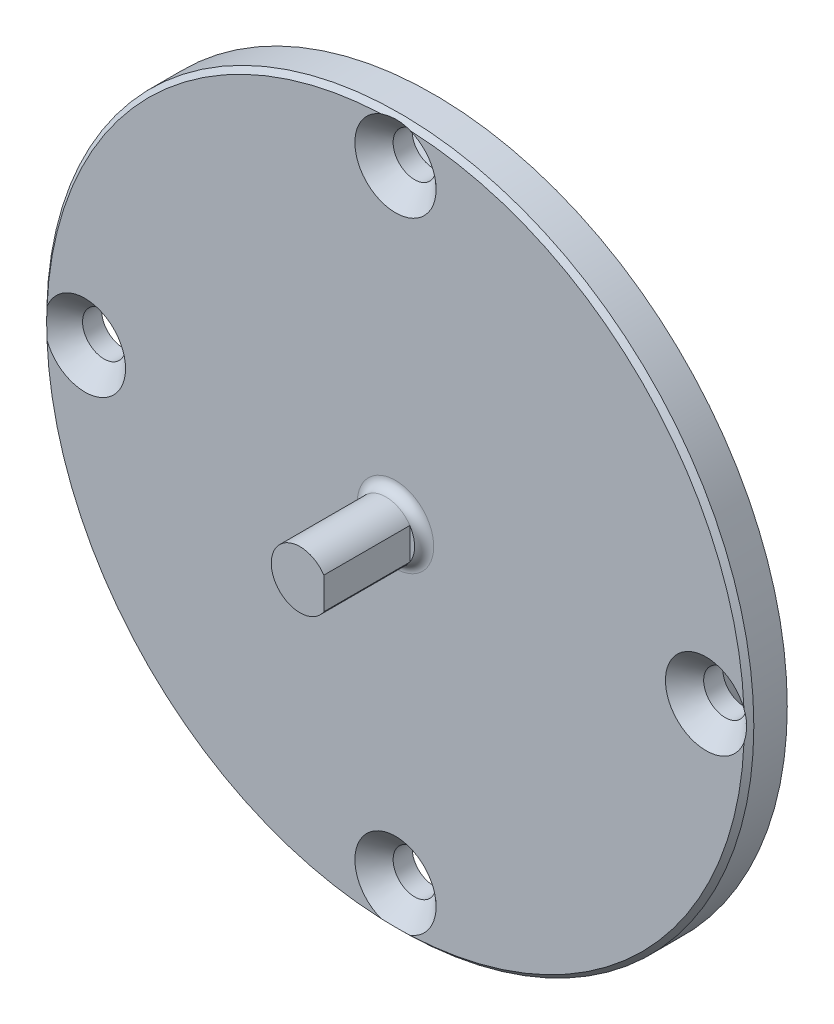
ISO-10303-21;
HEADER;
FILE_DESCRIPTION(('STEP AP214'),'2;1');
FILE_NAME('part.step','',(''),(''),'','','');
FILE_SCHEMA(('AUTOMOTIVE_DESIGN { 1 0 10303 214 1 1 1 1 }'));
ENDSEC;
DATA;
#1=APPLICATION_CONTEXT('core data for automotive mechanical design processes');
#2=APPLICATION_PROTOCOL_DEFINITION('international standard','automotive_design',2000,#1);
#3=PRODUCT_CONTEXT('',#1,'mechanical');
#4=PRODUCT('Part','Part','',(#3));
#5=PRODUCT_RELATED_PRODUCT_CATEGORY('part','',(#4));
#6=PRODUCT_DEFINITION_FORMATION('','',#4);
#7=PRODUCT_DEFINITION_CONTEXT('part definition',#1,'design');
#8=PRODUCT_DEFINITION('design','',#6,#7);
#9=PRODUCT_DEFINITION_SHAPE('','',#8);
#10=(LENGTH_UNIT() NAMED_UNIT(*) SI_UNIT(.MILLI.,.METRE.));
#11=(NAMED_UNIT(*) PLANE_ANGLE_UNIT() SI_UNIT($,.RADIAN.));
#12=(NAMED_UNIT(*) SI_UNIT($,.STERADIAN.) SOLID_ANGLE_UNIT());
#13=UNCERTAINTY_MEASURE_WITH_UNIT(LENGTH_MEASURE(1.E-05),#10,'distance_accuracy_value','');
#14=(GEOMETRIC_REPRESENTATION_CONTEXT(3) GLOBAL_UNCERTAINTY_ASSIGNED_CONTEXT((#13)) GLOBAL_UNIT_ASSIGNED_CONTEXT((#10,
#11,#12)) REPRESENTATION_CONTEXT('',''));
#15=CARTESIAN_POINT('',(0.,0.,0.));
#16=DIRECTION('',(0.,0.,1.));
#17=DIRECTION('',(1.,0.,0.));
#18=AXIS2_PLACEMENT_3D('',#15,#16,#17);
#19=CARTESIAN_POINT('',(0.,0.,0.));
#20=DIRECTION('',(0.,0.,1.));
#21=DIRECTION('',(1.,0.,0.));
#22=AXIS2_PLACEMENT_3D('',#19,#20,#21);
#23=PLANE('',#22);
#24=CARTESIAN_POINT('',(0.,0.,0.));
#25=DIRECTION('',(0.,0.,1.));
#26=DIRECTION('',(1.,0.,0.));
#27=AXIS2_PLACEMENT_3D('',#24,#25,#26);
#28=CIRCLE('',#27,28.8);
#29=CARTESIAN_POINT('',(28.8,0.,0.));
#30=VERTEX_POINT('',#29);
#31=EDGE_CURVE('E11',#30,#30,#28,.T.);
#32=ORIENTED_EDGE('',*,*,#31,.T.);
#33=EDGE_LOOP('',(#32));
#34=FACE_BOUND('',#33,.T.);
#35=CARTESIAN_POINT('',(1.13473209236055E-13,-32.5,0.));
#36=DIRECTION('',(0.,0.,1.));
#37=DIRECTION('',(1.,0.,0.));
#38=AXIS2_PLACEMENT_3D('',#35,#36,#37);
#39=CIRCLE('',#38,2.25);
#40=CARTESIAN_POINT('',(2.25000000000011,-32.5,0.));
#41=VERTEX_POINT('',#40);
#42=EDGE_CURVE('E234',#41,#41,#39,.F.);
#43=ORIENTED_EDGE('',*,*,#42,.F.);
#44=EDGE_LOOP('',(#43));
#45=FACE_BOUND('',#44,.T.);
#46=CARTESIAN_POINT('',(1.13473209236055E-13,32.5,0.));
#47=DIRECTION('',(0.,0.,1.));
#48=DIRECTION('',(1.,0.,0.));
#49=AXIS2_PLACEMENT_3D('',#46,#47,#48);
#50=CIRCLE('',#49,2.25);
#51=CARTESIAN_POINT('',(2.25000000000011,32.5,0.));
#52=VERTEX_POINT('',#51);
#53=EDGE_CURVE('E124',#52,#52,#50,.F.);
#54=ORIENTED_EDGE('',*,*,#53,.F.);
#55=EDGE_LOOP('',(#54));
#56=FACE_BOUND('',#55,.T.);
#57=CARTESIAN_POINT('',(0.,0.,0.));
#58=DIRECTION('',(0.,0.,1.));
#59=DIRECTION('',(1.,0.,0.));
#60=AXIS2_PLACEMENT_3D('',#57,#58,#59);
#61=CIRCLE('',#60,37.);
#62=CARTESIAN_POINT('',(37.,0.,0.));
#63=VERTEX_POINT('',#62);
#64=EDGE_CURVE('E102',#63,#63,#61,.T.);
#65=ORIENTED_EDGE('',*,*,#64,.F.);
#66=EDGE_LOOP('',(#65));
#67=FACE_BOUND('',#66,.T.);
#68=CARTESIAN_POINT('',(-32.5,0.,0.));
#69=DIRECTION('',(0.,0.,1.));
#70=DIRECTION('',(1.,0.,0.));
#71=AXIS2_PLACEMENT_3D('',#68,#69,#70);
#72=CIRCLE('',#71,2.25);
#73=CARTESIAN_POINT('',(-30.25,0.,0.));
#74=VERTEX_POINT('',#73);
#75=EDGE_CURVE('E226',#74,#74,#72,.F.);
#76=ORIENTED_EDGE('',*,*,#75,.F.);
#77=EDGE_LOOP('',(#76));
#78=FACE_BOUND('',#77,.T.);
#79=CARTESIAN_POINT('',(32.5,2.2694641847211E-13,0.));
#80=DIRECTION('',(0.,0.,1.));
#81=DIRECTION('',(1.,0.,0.));
#82=AXIS2_PLACEMENT_3D('',#79,#80,#81);
#83=CIRCLE('',#82,2.25);
#84=CARTESIAN_POINT('',(34.75,2.2694641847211E-13,0.));
#85=VERTEX_POINT('',#84);
#86=EDGE_CURVE('E95',#85,#85,#83,.F.);
#87=ORIENTED_EDGE('',*,*,#86,.F.);
#88=EDGE_LOOP('',(#87));
#89=FACE_BOUND('',#88,.T.);
#90=ADVANCED_FACE('F31',(#34,#45,#56,#67,#78,#89),#23,.F.);
#91=CARTESIAN_POINT('',(0.,0.,4.));
#92=DIRECTION('',(0.,0.,-1.));
#93=DIRECTION('',(-1.,0.,0.));
#94=AXIS2_PLACEMENT_3D('',#91,#92,#93);
#95=CONICAL_SURFACE('',#94,36.5,0.785398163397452);
#96=CARTESIAN_POINT('',(0.,0.,3.5));
#97=DIRECTION('',(0.,0.,1.));
#98=DIRECTION('',(1.,0.,0.));
#99=AXIS2_PLACEMENT_3D('',#96,#97,#98);
#100=CIRCLE('',#99,37.);
#101=CARTESIAN_POINT('',(37.,0.,3.5));
#102=VERTEX_POINT('',#101);
#103=EDGE_CURVE('E106',#102,#102,#100,.F.);
#104=ORIENTED_EDGE('',*,*,#103,.F.);
#105=EDGE_LOOP('',(#104));
#106=FACE_BOUND('',#105,.T.);
#107=CARTESIAN_POINT('',(0.,0.,4.));
#108=DIRECTION('',(0.,0.,1.));
#109=DIRECTION('',(1.,0.,0.));
#110=AXIS2_PLACEMENT_3D('',#107,#108,#109);
#111=CIRCLE('',#110,36.5);
#112=CARTESIAN_POINT('',(36.4682692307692,1.52162390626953,4.));
#113=VERTEX_POINT('',#112);
#114=CARTESIAN_POINT('',(1.52162390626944,36.4682692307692,4.));
#115=VERTEX_POINT('',#114);
#116=EDGE_CURVE('E94',#113,#115,#111,.T.);
#117=ORIENTED_EDGE('',*,*,#116,.F.);
#118=CARTESIAN_POINT('',(36.4680184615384,1.52283601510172,4.0002));
#119=CARTESIAN_POINT('',(36.4850451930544,1.44057411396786,3.98662039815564));
#120=CARTESIAN_POINT('',(36.5007588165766,1.35787566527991,3.97408806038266));
#121=CARTESIAN_POINT('',(36.5294820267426,1.19170734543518,3.9511799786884));
#122=CARTESIAN_POINT('',(36.542491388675,1.108237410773,3.94080441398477));
#123=CARTESIAN_POINT('',(36.5773484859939,0.85679967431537,3.91300427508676));
#124=CARTESIAN_POINT('',(36.595016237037,0.687847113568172,3.89891343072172));
#125=CARTESIAN_POINT('',(36.6184873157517,0.352342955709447,3.8801941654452));
#126=CARTESIAN_POINT('',(36.6245419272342,0.185819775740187,3.87536533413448));
#127=CARTESIAN_POINT('',(36.6254077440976,-0.147183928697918,3.87467480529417));
#128=CARTESIAN_POINT('',(36.6202249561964,-0.313664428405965,3.87880831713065));
#129=CARTESIAN_POINT('',(36.5981529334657,-0.654640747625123,3.89641177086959));
#130=CARTESIAN_POINT('',(36.5806325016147,-0.829071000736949,3.9103851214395));
#131=CARTESIAN_POINT('',(36.5452935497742,-1.08970294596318,3.93856956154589));
#132=CARTESIAN_POINT('',(36.5318970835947,-1.1769261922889,3.94925385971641));
#133=CARTESIAN_POINT('',(36.5021505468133,-1.3505369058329,3.97297809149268));
#134=CARTESIAN_POINT('',(36.4858007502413,-1.43692444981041,3.98601780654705));
#135=CARTESIAN_POINT('',(36.4680184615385,-1.52283601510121,4.0002));
#136=B_SPLINE_CURVE_WITH_KNOTS('',3,(#118,#119,#120,#121,#122,#123,#124,#125,#126,#127,#128,
#129,#130,#131,#132,#133,#134,#135),.UNSPECIFIED.,.F.,.F.,(4,2,2,2,2,2,2,2,4),(0.,
0.255252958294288,0.510527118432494,1.02120905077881,1.52071043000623,2.01994487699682,
2.5467726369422,2.81337195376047,3.07994654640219),.UNSPECIFIED.);
#137=CARTESIAN_POINT('',(36.4682692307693,-1.52162390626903,4.));
#138=VERTEX_POINT('',#137);
#139=EDGE_CURVE('E45',#113,#138,#136,.T.);
#140=ORIENTED_EDGE('',*,*,#139,.T.);
#141=CARTESIAN_POINT('',(1.52162390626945,-36.4682692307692,4.));
#142=VERTEX_POINT('',#141);
#143=EDGE_CURVE('E92',#142,#138,#111,.T.);
#144=ORIENTED_EDGE('',*,*,#143,.F.);
#145=CARTESIAN_POINT('',(1.52283601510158,-36.4680184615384,4.0002));
#146=CARTESIAN_POINT('',(1.44057411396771,-36.4850451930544,3.98662039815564));
#147=CARTESIAN_POINT('',(1.35787566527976,-36.5007588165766,3.97408806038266));
#148=CARTESIAN_POINT('',(1.19170734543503,-36.5294820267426,3.9511799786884));
#149=CARTESIAN_POINT('',(1.10823741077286,-36.542491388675,3.94080441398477));
#150=CARTESIAN_POINT('',(0.856799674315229,-36.5773484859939,3.91300427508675));
#151=CARTESIAN_POINT('',(0.687847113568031,-36.595016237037,3.89891343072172));
#152=CARTESIAN_POINT('',(0.352342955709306,-36.6184873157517,3.8801941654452));
#153=CARTESIAN_POINT('',(0.185819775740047,-36.6245419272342,3.87536533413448));
#154=CARTESIAN_POINT('',(-0.147183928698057,-36.6254077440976,3.87467480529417));
#155=CARTESIAN_POINT('',(-0.313664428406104,-36.6202249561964,3.87880831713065));
#156=CARTESIAN_POINT('',(-0.654640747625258,-36.5981529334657,3.89641177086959));
#157=CARTESIAN_POINT('',(-0.829071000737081,-36.5806325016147,3.9103851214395));
#158=CARTESIAN_POINT('',(-1.08970294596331,-36.5452935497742,3.9385695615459));
#159=CARTESIAN_POINT('',(-1.17692619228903,-36.5318970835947,3.94925385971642));
#160=CARTESIAN_POINT('',(-1.35053690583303,-36.5021505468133,3.97297809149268));
#161=CARTESIAN_POINT('',(-1.43692444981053,-36.4858007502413,3.98601780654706));
#162=CARTESIAN_POINT('',(-1.52283601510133,-36.4680184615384,4.0002));
#163=B_SPLINE_CURVE_WITH_KNOTS('',3,(#145,#146,#147,#148,#149,#150,#151,#152,#153,#154,#155,
#156,#157,#158,#159,#160,#161,#162),.UNSPECIFIED.,.F.,.F.,(4,2,2,2,2,2,2,2,4),(0.,
0.255252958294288,0.510527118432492,1.02120905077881,1.52071043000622,2.01994487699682,
2.54677263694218,2.81337195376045,3.07994654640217),.UNSPECIFIED.);
#164=CARTESIAN_POINT('',(-1.52162390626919,-36.4682692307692,4.));
#165=VERTEX_POINT('',#164);
#166=EDGE_CURVE('E237',#142,#165,#163,.T.);
#167=ORIENTED_EDGE('',*,*,#166,.T.);
#168=CARTESIAN_POINT('',(-36.4682692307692,-1.52162390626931,4.));
#169=VERTEX_POINT('',#168);
#170=EDGE_CURVE('E99',#169,#165,#111,.T.);
#171=ORIENTED_EDGE('',*,*,#170,.F.);
#172=CARTESIAN_POINT('',(-36.4680184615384,-1.52283601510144,4.0002));
#173=CARTESIAN_POINT('',(-36.4850451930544,-1.44057411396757,3.98662039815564));
#174=CARTESIAN_POINT('',(-36.5007588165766,-1.35787566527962,3.97408806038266));
#175=CARTESIAN_POINT('',(-36.5294820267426,-1.19170734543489,3.9511799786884));
#176=CARTESIAN_POINT('',(-36.542491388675,-1.10823741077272,3.94080441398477));
#177=CARTESIAN_POINT('',(-36.5773484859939,-0.856799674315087,3.91300427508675));
#178=CARTESIAN_POINT('',(-36.595016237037,-0.687847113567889,3.89891343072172));
#179=CARTESIAN_POINT('',(-36.6184873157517,-0.352342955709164,3.8801941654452));
#180=CARTESIAN_POINT('',(-36.6245419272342,-0.185819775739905,3.87536533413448));
#181=CARTESIAN_POINT('',(-36.6254077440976,0.1471839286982,3.87467480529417));
#182=CARTESIAN_POINT('',(-36.6202249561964,0.313664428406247,3.87880831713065));
#183=CARTESIAN_POINT('',(-36.5981529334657,0.654640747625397,3.89641177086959));
#184=CARTESIAN_POINT('',(-36.5806325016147,0.829071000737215,3.9103851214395));
#185=CARTESIAN_POINT('',(-36.5452935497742,1.08970294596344,3.9385695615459));
#186=CARTESIAN_POINT('',(-36.5318970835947,1.17692619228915,3.94925385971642));
#187=CARTESIAN_POINT('',(-36.5021505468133,1.35053690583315,3.97297809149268));
#188=CARTESIAN_POINT('',(-36.4858007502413,1.43692444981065,3.98601780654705));
#189=CARTESIAN_POINT('',(-36.4680184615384,1.52283601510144,4.0002));
#190=B_SPLINE_CURVE_WITH_KNOTS('',3,(#172,#173,#174,#175,#176,#177,#178,#179,#180,#181,#182,
#183,#184,#185,#186,#187,#188,#189),.UNSPECIFIED.,.F.,.F.,(4,2,2,2,2,2,2,2,4),(0.,
0.255252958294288,0.510527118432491,1.02120905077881,1.52071043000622,2.01994487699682,
2.54677263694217,2.81337195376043,3.07994654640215),.UNSPECIFIED.);
#191=CARTESIAN_POINT('',(-36.4682692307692,1.52162390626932,4.));
#192=VERTEX_POINT('',#191);
#193=EDGE_CURVE('E123',#169,#192,#190,.T.);
#194=ORIENTED_EDGE('',*,*,#193,.T.);
#195=CARTESIAN_POINT('',(-1.52162390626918,36.4682692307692,4.));
#196=VERTEX_POINT('',#195);
#197=EDGE_CURVE('E101',#196,#192,#111,.T.);
#198=ORIENTED_EDGE('',*,*,#197,.F.);
#199=CARTESIAN_POINT('',(-1.52283601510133,36.4680184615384,4.0002));
#200=CARTESIAN_POINT('',(-1.44057411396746,36.4850451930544,3.98662039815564));
#201=CARTESIAN_POINT('',(-1.35787566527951,36.5007588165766,3.97408806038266));
#202=CARTESIAN_POINT('',(-1.19170734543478,36.5294820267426,3.9511799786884));
#203=CARTESIAN_POINT('',(-1.10823741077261,36.542491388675,3.94080441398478));
#204=CARTESIAN_POINT('',(-0.856799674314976,36.5773484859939,3.91300427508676));
#205=CARTESIAN_POINT('',(-0.687847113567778,36.595016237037,3.89891343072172));
#206=CARTESIAN_POINT('',(-0.352342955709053,36.6184873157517,3.8801941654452));
#207=CARTESIAN_POINT('',(-0.185819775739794,36.6245419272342,3.87536533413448));
#208=CARTESIAN_POINT('',(0.147183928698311,36.6254077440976,3.87467480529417));
#209=CARTESIAN_POINT('',(0.313664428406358,36.6202249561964,3.87880831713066));
#210=CARTESIAN_POINT('',(0.654640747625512,36.5981529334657,3.89641177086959));
#211=CARTESIAN_POINT('',(0.829071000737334,36.5806325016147,3.9103851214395));
#212=CARTESIAN_POINT('',(1.08970294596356,36.5452935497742,3.9385695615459));
#213=CARTESIAN_POINT('',(1.17692619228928,36.5318970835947,3.94925385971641));
#214=CARTESIAN_POINT('',(1.35053690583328,36.5021505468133,3.97297809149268));
#215=CARTESIAN_POINT('',(1.43692444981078,36.4858007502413,3.98601780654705));
#216=CARTESIAN_POINT('',(1.52283601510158,36.4680184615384,4.0002));
#217=B_SPLINE_CURVE_WITH_KNOTS('',3,(#199,#200,#201,#202,#203,#204,#205,#206,#207,#208,#209,
#210,#211,#212,#213,#214,#215,#216),.UNSPECIFIED.,.F.,.F.,(4,2,2,2,2,2,2,2,4),(0.,
0.255252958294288,0.510527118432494,1.02120905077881,1.52071043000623,2.01994487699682,
2.54677263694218,2.81337195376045,3.07994654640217),.UNSPECIFIED.);
#218=EDGE_CURVE('E116',#196,#115,#217,.T.);
#219=ORIENTED_EDGE('',*,*,#218,.T.);
#220=EDGE_LOOP('',(#117,#140,#144,#167,#171,#194,#198,#219));
#221=FACE_BOUND('',#220,.T.);
#222=ADVANCED_FACE('F91',(#106,#221),#95,.T.);
#223=CARTESIAN_POINT('',(0.,0.,4.));
#224=DIRECTION('',(0.,0.,1.));
#225=DIRECTION('',(1.,0.,0.));
#226=AXIS2_PLACEMENT_3D('',#223,#224,#225);
#227=PLANE('',#226);
#228=CARTESIAN_POINT('',(0.,0.,4.));
#229=DIRECTION('',(0.,0.,1.));
#230=DIRECTION('',(1.,0.,0.));
#231=AXIS2_PLACEMENT_3D('',#228,#229,#230);
#232=CIRCLE('',#231,4.);
#233=CARTESIAN_POINT('',(4.,0.,4.));
#234=VERTEX_POINT('',#233);
#235=EDGE_CURVE('E113',#234,#234,#232,.F.);
#236=ORIENTED_EDGE('',*,*,#235,.T.);
#237=EDGE_LOOP('',(#236));
#238=FACE_BOUND('',#237,.T.);
#239=ORIENTED_EDGE('',*,*,#143,.T.);
#240=CARTESIAN_POINT('',(32.5,2.2694641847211E-13,4.));
#241=DIRECTION('',(0.,0.,1.));
#242=DIRECTION('',(1.,0.,0.));
#243=AXIS2_PLACEMENT_3D('',#240,#241,#242);
#244=CIRCLE('',#243,4.25);
#245=EDGE_CURVE('E81',#113,#138,#244,.T.);
#246=ORIENTED_EDGE('',*,*,#245,.F.);
#247=ORIENTED_EDGE('',*,*,#116,.T.);
#248=CARTESIAN_POINT('',(1.13473209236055E-13,32.5,4.));
#249=DIRECTION('',(0.,0.,1.));
#250=DIRECTION('',(1.,0.,0.));
#251=AXIS2_PLACEMENT_3D('',#248,#249,#250);
#252=CIRCLE('',#251,4.25);
#253=EDGE_CURVE('E274',#196,#115,#252,.T.);
#254=ORIENTED_EDGE('',*,*,#253,.F.);
#255=ORIENTED_EDGE('',*,*,#197,.T.);
#256=CARTESIAN_POINT('',(-32.5,0.,4.));
#257=DIRECTION('',(0.,0.,1.));
#258=DIRECTION('',(1.,0.,0.));
#259=AXIS2_PLACEMENT_3D('',#256,#257,#258);
#260=CIRCLE('',#259,4.25);
#261=EDGE_CURVE('E269',#169,#192,#260,.T.);
#262=ORIENTED_EDGE('',*,*,#261,.F.);
#263=ORIENTED_EDGE('',*,*,#170,.T.);
#264=CARTESIAN_POINT('',(1.13473209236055E-13,-32.5,4.));
#265=DIRECTION('',(0.,0.,1.));
#266=DIRECTION('',(1.,0.,0.));
#267=AXIS2_PLACEMENT_3D('',#264,#265,#266);
#268=CIRCLE('',#267,4.25);
#269=EDGE_CURVE('E52',#142,#165,#268,.T.);
#270=ORIENTED_EDGE('',*,*,#269,.F.);
#271=EDGE_LOOP('',(#239,#246,#247,#254,#255,#262,#263,#270));
#272=FACE_BOUND('',#271,.T.);
#273=ADVANCED_FACE('F97',(#238,#272),#227,.T.);
#274=CARTESIAN_POINT('',(0.,0.,4.));
#275=DIRECTION('',(0.,0.,-1.));
#276=DIRECTION('',(-1.,0.,0.));
#277=AXIS2_PLACEMENT_3D('',#274,#275,#276);
#278=CYLINDRICAL_SURFACE('',#277,37.);
#279=ORIENTED_EDGE('',*,*,#103,.T.);
#280=EDGE_LOOP('',(#279));
#281=FACE_BOUND('',#280,.T.);
#282=ORIENTED_EDGE('',*,*,#64,.T.);
#283=EDGE_LOOP('',(#282));
#284=FACE_BOUND('',#283,.T.);
#285=ADVANCED_FACE('F33',(#281,#284),#278,.T.);
#286=CARTESIAN_POINT('',(0.,0.,-5.));
#287=DIRECTION('',(0.,0.,-1.));
#288=DIRECTION('',(-1.,0.,0.));
#289=AXIS2_PLACEMENT_3D('',#286,#287,#288);
#290=PLANE('',#289);
#291=CARTESIAN_POINT('',(0.,0.,-5.));
#292=DIRECTION('',(0.,0.,-1.));
#293=DIRECTION('',(-1.,0.,0.));
#294=AXIS2_PLACEMENT_3D('',#291,#292,#293);
#295=CIRCLE('',#294,28.5);
#296=CARTESIAN_POINT('',(-28.5,0.,-5.));
#297=VERTEX_POINT('',#296);
#298=EDGE_CURVE('E214',#297,#297,#295,.T.);
#299=ORIENTED_EDGE('',*,*,#298,.T.);
#300=EDGE_LOOP('',(#299));
#301=FACE_BOUND('',#300,.T.);
#302=CARTESIAN_POINT('',(0.,0.,-5.));
#303=DIRECTION('',(0.,0.,-1.));
#304=DIRECTION('',(-1.,0.,0.));
#305=AXIS2_PLACEMENT_3D('',#302,#303,#304);
#306=CIRCLE('',#305,23.);
#307=CARTESIAN_POINT('',(-23.,0.,-5.));
#308=VERTEX_POINT('',#307);
#309=EDGE_CURVE('E212',#308,#308,#306,.T.);
#310=ORIENTED_EDGE('',*,*,#309,.F.);
#311=EDGE_LOOP('',(#310));
#312=FACE_BOUND('',#311,.T.);
#313=ADVANCED_FACE('F185',(#301,#312),#290,.T.);
#314=CARTESIAN_POINT('',(0.,0.,-5.));
#315=DIRECTION('',(0.,0.,1.));
#316=DIRECTION('',(1.,0.,0.));
#317=AXIS2_PLACEMENT_3D('',#314,#315,#316);
#318=CYLINDRICAL_SURFACE('',#317,28.5);
#319=CARTESIAN_POINT('',(0.,0.,-0.3));
#320=DIRECTION('',(0.,0.,1.));
#321=DIRECTION('',(1.,0.,0.));
#322=AXIS2_PLACEMENT_3D('',#319,#320,#321);
#323=CIRCLE('',#322,28.5);
#324=CARTESIAN_POINT('',(28.5,0.,-0.3));
#325=VERTEX_POINT('',#324);
#326=EDGE_CURVE('E39',#325,#325,#323,.F.);
#327=ORIENTED_EDGE('',*,*,#326,.T.);
#328=EDGE_LOOP('',(#327));
#329=FACE_BOUND('',#328,.T.);
#330=ORIENTED_EDGE('',*,*,#298,.F.);
#331=EDGE_LOOP('',(#330));
#332=FACE_BOUND('',#331,.T.);
#333=ADVANCED_FACE('F178',(#329,#332),#318,.T.);
#334=CARTESIAN_POINT('',(0.,0.,-5.));
#335=DIRECTION('',(0.,0.,1.));
#336=DIRECTION('',(1.,0.,0.));
#337=AXIS2_PLACEMENT_3D('',#334,#335,#336);
#338=CYLINDRICAL_SURFACE('',#337,23.);
#339=ORIENTED_EDGE('',*,*,#309,.T.);
#340=EDGE_LOOP('',(#339));
#341=FACE_BOUND('',#340,.T.);
#342=CARTESIAN_POINT('',(0.,0.,0.));
#343=DIRECTION('',(0.,0.,-1.));
#344=DIRECTION('',(-1.,0.,0.));
#345=AXIS2_PLACEMENT_3D('',#342,#343,#344);
#346=CIRCLE('',#345,23.);
#347=CARTESIAN_POINT('',(-23.,0.,0.));
#348=VERTEX_POINT('',#347);
#349=EDGE_CURVE('E206',#348,#348,#346,.T.);
#350=ORIENTED_EDGE('',*,*,#349,.F.);
#351=EDGE_LOOP('',(#350));
#352=FACE_BOUND('',#351,.T.);
#353=ADVANCED_FACE('F164',(#341,#352),#338,.F.);
#354=ORIENTED_EDGE('',*,*,#349,.T.);
#355=EDGE_LOOP('',(#354));
#356=FACE_BOUND('',#355,.T.);
#357=ADVANCED_FACE('F158',(#356),#23,.F.);
#358=CARTESIAN_POINT('',(0.,0.,14.));
#359=DIRECTION('',(0.,0.,-1.));
#360=DIRECTION('',(-1.,0.,0.));
#361=AXIS2_PLACEMENT_3D('',#358,#359,#360);
#362=CYLINDRICAL_SURFACE('',#361,3.);
#363=CARTESIAN_POINT('',(0.,0.,14.));
#364=DIRECTION('',(0.,0.,1.));
#365=DIRECTION('',(1.,0.,0.));
#366=AXIS2_PLACEMENT_3D('',#363,#364,#365);
#367=CIRCLE('',#366,3.);
#368=CARTESIAN_POINT('',(2.5,1.65831239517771,14.));
#369=VERTEX_POINT('',#368);
#370=CARTESIAN_POINT('',(2.5,-1.65831239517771,14.));
#371=VERTEX_POINT('',#370);
#372=EDGE_CURVE('E204',#369,#371,#367,.T.);
#373=ORIENTED_EDGE('',*,*,#372,.F.);
#374=DIRECTION('',(0.,0.,-1.));
#375=VECTOR('',#374,1.);
#376=CARTESIAN_POINT('',(2.5,1.65831239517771,14.));
#377=LINE('',#376,#375);
#378=CARTESIAN_POINT('',(2.5,1.65831239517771,5.));
#379=VERTEX_POINT('',#378);
#380=EDGE_CURVE('E201',#369,#379,#377,.T.);
#381=ORIENTED_EDGE('',*,*,#380,.T.);
#382=CARTESIAN_POINT('',(0.,0.,5.));
#383=DIRECTION('',(0.,0.,1.));
#384=DIRECTION('',(1.,0.,0.));
#385=AXIS2_PLACEMENT_3D('',#382,#383,#384);
#386=CIRCLE('',#385,3.);
#387=CARTESIAN_POINT('',(2.5,-1.65831239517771,5.));
#388=VERTEX_POINT('',#387);
#389=EDGE_CURVE('E110',#379,#388,#386,.T.);
#390=ORIENTED_EDGE('',*,*,#389,.T.);
#391=DIRECTION('',(0.,0.,-1.));
#392=VECTOR('',#391,1.);
#393=CARTESIAN_POINT('',(2.5,-1.65831239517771,14.));
#394=LINE('',#393,#392);
#395=EDGE_CURVE('E195',#388,#371,#394,.F.);
#396=ORIENTED_EDGE('',*,*,#395,.T.);
#397=EDGE_LOOP('',(#373,#381,#390,#396));
#398=FACE_BOUND('',#397,.T.);
#399=ADVANCED_FACE('F155',(#398),#362,.T.);
#400=CARTESIAN_POINT('',(0.,0.,14.));
#401=DIRECTION('',(0.,0.,1.));
#402=DIRECTION('',(1.,0.,0.));
#403=AXIS2_PLACEMENT_3D('',#400,#401,#402);
#404=PLANE('',#403);
#405=DIRECTION('',(0.,1.,0.));
#406=VECTOR('',#405,1.);
#407=CARTESIAN_POINT('',(2.5,-37.,14.));
#408=LINE('',#407,#406);
#409=EDGE_CURVE('E199',#371,#369,#408,.T.);
#410=ORIENTED_EDGE('',*,*,#409,.T.);
#411=ORIENTED_EDGE('',*,*,#372,.T.);
#412=EDGE_LOOP('',(#410,#411));
#413=FACE_BOUND('',#412,.T.);
#414=ADVANCED_FACE('F152',(#413),#404,.T.);
#415=CARTESIAN_POINT('',(0.,0.,5.));
#416=DIRECTION('',(0.,0.,1.));
#417=DIRECTION('',(1.,0.,0.));
#418=AXIS2_PLACEMENT_3D('',#415,#416,#417);
#419=TOROIDAL_SURFACE('',#418,4.,1.);
#420=ORIENTED_EDGE('',*,*,#235,.F.);
#421=EDGE_LOOP('',(#420));
#422=FACE_BOUND('',#421,.T.);
#423=EDGE_CURVE('E111',#388,#379,#386,.T.);
#424=ORIENTED_EDGE('',*,*,#423,.F.);
#425=ORIENTED_EDGE('',*,*,#389,.F.);
#426=EDGE_LOOP('',(#424,#425));
#427=FACE_BOUND('',#426,.T.);
#428=ADVANCED_FACE('F148',(#422,#427),#419,.F.);
#429=CARTESIAN_POINT('',(2.5,-37.,5.));
#430=DIRECTION('',(-1.,0.,0.));
#431=DIRECTION('',(0.,0.,1.));
#432=AXIS2_PLACEMENT_3D('',#429,#430,#431);
#433=PLANE('',#432);
#434=ORIENTED_EDGE('',*,*,#409,.F.);
#435=ORIENTED_EDGE('',*,*,#395,.F.);
#436=DIRECTION('',(0.,1.,0.));
#437=VECTOR('',#436,1.);
#438=CARTESIAN_POINT('',(2.5,-37.,5.));
#439=LINE('',#438,#437);
#440=EDGE_CURVE('E196',#388,#379,#439,.T.);
#441=ORIENTED_EDGE('',*,*,#440,.T.);
#442=ORIENTED_EDGE('',*,*,#380,.F.);
#443=EDGE_LOOP('',(#434,#435,#441,#442));
#444=FACE_BOUND('',#443,.T.);
#445=ADVANCED_FACE('F144',(#444),#433,.F.);
#446=CARTESIAN_POINT('',(2.5,-37.,5.));
#447=DIRECTION('',(0.,0.,1.));
#448=DIRECTION('',(1.,0.,0.));
#449=AXIS2_PLACEMENT_3D('',#446,#447,#448);
#450=PLANE('',#449);
#451=ORIENTED_EDGE('',*,*,#440,.F.);
#452=ORIENTED_EDGE('',*,*,#423,.T.);
#453=EDGE_LOOP('',(#451,#452));
#454=FACE_BOUND('',#453,.T.);
#455=ADVANCED_FACE('F140',(#454),#450,.T.);
#456=CARTESIAN_POINT('',(1.13473209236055E-13,32.5,4.));
#457=DIRECTION('',(0.,0.,1.));
#458=DIRECTION('',(1.,0.,0.));
#459=AXIS2_PLACEMENT_3D('',#456,#457,#458);
#460=CYLINDRICAL_SURFACE('',#459,2.25);
#461=CARTESIAN_POINT('',(1.13473209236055E-13,32.5,2.));
#462=DIRECTION('',(0.,0.,1.));
#463=DIRECTION('',(1.,0.,0.));
#464=AXIS2_PLACEMENT_3D('',#461,#462,#463);
#465=CIRCLE('',#464,2.25);
#466=CARTESIAN_POINT('',(2.25000000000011,32.5,2.));
#467=VERTEX_POINT('',#466);
#468=EDGE_CURVE('E280',#467,#467,#465,.T.);
#469=ORIENTED_EDGE('',*,*,#468,.T.);
#470=EDGE_LOOP('',(#469));
#471=FACE_BOUND('',#470,.T.);
#472=ORIENTED_EDGE('',*,*,#53,.T.);
#473=EDGE_LOOP('',(#472));
#474=FACE_BOUND('',#473,.T.);
#475=ADVANCED_FACE('F135',(#471,#474),#460,.F.);
#476=CARTESIAN_POINT('',(1.13473209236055E-13,32.5,2.));
#477=DIRECTION('',(0.,0.,1.));
#478=DIRECTION('',(1.,0.,0.));
#479=AXIS2_PLACEMENT_3D('',#476,#477,#478);
#480=CONICAL_SURFACE('',#479,2.25,0.785398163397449);
#481=ORIENTED_EDGE('',*,*,#253,.T.);
#482=ORIENTED_EDGE('',*,*,#218,.F.);
#483=EDGE_LOOP('',(#481,#482));
#484=FACE_BOUND('',#483,.T.);
#485=ORIENTED_EDGE('',*,*,#468,.F.);
#486=EDGE_LOOP('',(#485));
#487=FACE_BOUND('',#486,.T.);
#488=ADVANCED_FACE('F129',(#484,#487),#480,.F.);
#489=CARTESIAN_POINT('',(-32.5,0.,4.));
#490=DIRECTION('',(0.,0.,1.));
#491=DIRECTION('',(1.,0.,0.));
#492=AXIS2_PLACEMENT_3D('',#489,#490,#491);
#493=CYLINDRICAL_SURFACE('',#492,2.25);
#494=CARTESIAN_POINT('',(-32.5,0.,2.));
#495=DIRECTION('',(0.,0.,1.));
#496=DIRECTION('',(1.,0.,0.));
#497=AXIS2_PLACEMENT_3D('',#494,#495,#496);
#498=CIRCLE('',#497,2.25);
#499=CARTESIAN_POINT('',(-30.25,0.,2.));
#500=VERTEX_POINT('',#499);
#501=EDGE_CURVE('E272',#500,#500,#498,.T.);
#502=ORIENTED_EDGE('',*,*,#501,.T.);
#503=EDGE_LOOP('',(#502));
#504=FACE_BOUND('',#503,.T.);
#505=ORIENTED_EDGE('',*,*,#75,.T.);
#506=EDGE_LOOP('',(#505));
#507=FACE_BOUND('',#506,.T.);
#508=ADVANCED_FACE('F134',(#504,#507),#493,.F.);
#509=CARTESIAN_POINT('',(-32.5,0.,2.));
#510=DIRECTION('',(0.,0.,1.));
#511=DIRECTION('',(1.,0.,0.));
#512=AXIS2_PLACEMENT_3D('',#509,#510,#511);
#513=CONICAL_SURFACE('',#512,2.25,0.78539816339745);
#514=ORIENTED_EDGE('',*,*,#261,.T.);
#515=ORIENTED_EDGE('',*,*,#193,.F.);
#516=EDGE_LOOP('',(#514,#515));
#517=FACE_BOUND('',#516,.T.);
#518=ORIENTED_EDGE('',*,*,#501,.F.);
#519=EDGE_LOOP('',(#518));
#520=FACE_BOUND('',#519,.T.);
#521=ADVANCED_FACE('F256',(#517,#520),#513,.F.);
#522=CARTESIAN_POINT('',(1.13473209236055E-13,-32.5,4.));
#523=DIRECTION('',(0.,0.,1.));
#524=DIRECTION('',(1.,0.,0.));
#525=AXIS2_PLACEMENT_3D('',#522,#523,#524);
#526=CYLINDRICAL_SURFACE('',#525,2.25);
#527=CARTESIAN_POINT('',(1.13473209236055E-13,-32.5,2.));
#528=DIRECTION('',(0.,0.,1.));
#529=DIRECTION('',(1.,0.,0.));
#530=AXIS2_PLACEMENT_3D('',#527,#528,#529);
#531=CIRCLE('',#530,2.25);
#532=CARTESIAN_POINT('',(2.25000000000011,-32.5,2.));
#533=VERTEX_POINT('',#532);
#534=EDGE_CURVE('E231',#533,#533,#531,.T.);
#535=ORIENTED_EDGE('',*,*,#534,.T.);
#536=EDGE_LOOP('',(#535));
#537=FACE_BOUND('',#536,.T.);
#538=ORIENTED_EDGE('',*,*,#42,.T.);
#539=EDGE_LOOP('',(#538));
#540=FACE_BOUND('',#539,.T.);
#541=ADVANCED_FACE('F253',(#537,#540),#526,.F.);
#542=CARTESIAN_POINT('',(1.13473209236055E-13,-32.5,2.));
#543=DIRECTION('',(0.,0.,1.));
#544=DIRECTION('',(1.,0.,0.));
#545=AXIS2_PLACEMENT_3D('',#542,#543,#544);
#546=CONICAL_SURFACE('',#545,2.25,0.785398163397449);
#547=ORIENTED_EDGE('',*,*,#269,.T.);
#548=ORIENTED_EDGE('',*,*,#166,.F.);
#549=EDGE_LOOP('',(#547,#548));
#550=FACE_BOUND('',#549,.T.);
#551=ORIENTED_EDGE('',*,*,#534,.F.);
#552=EDGE_LOOP('',(#551));
#553=FACE_BOUND('',#552,.T.);
#554=ADVANCED_FACE('F247',(#550,#553),#546,.F.);
#555=CARTESIAN_POINT('',(32.5,2.2694641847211E-13,4.));
#556=DIRECTION('',(0.,0.,1.));
#557=DIRECTION('',(1.,0.,0.));
#558=AXIS2_PLACEMENT_3D('',#555,#556,#557);
#559=CYLINDRICAL_SURFACE('',#558,2.25);
#560=CARTESIAN_POINT('',(32.5,2.2694641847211E-13,2.));
#561=DIRECTION('',(0.,0.,1.));
#562=DIRECTION('',(1.,0.,0.));
#563=AXIS2_PLACEMENT_3D('',#560,#561,#562);
#564=CIRCLE('',#563,2.25);
#565=CARTESIAN_POINT('',(34.75,2.2694641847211E-13,2.));
#566=VERTEX_POINT('',#565);
#567=EDGE_CURVE('E87',#566,#566,#564,.T.);
#568=ORIENTED_EDGE('',*,*,#567,.T.);
#569=EDGE_LOOP('',(#568));
#570=FACE_BOUND('',#569,.T.);
#571=ORIENTED_EDGE('',*,*,#86,.T.);
#572=EDGE_LOOP('',(#571));
#573=FACE_BOUND('',#572,.T.);
#574=ADVANCED_FACE('F252',(#570,#573),#559,.F.);
#575=CARTESIAN_POINT('',(32.5,2.2694641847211E-13,2.));
#576=DIRECTION('',(0.,0.,1.));
#577=DIRECTION('',(1.,0.,0.));
#578=AXIS2_PLACEMENT_3D('',#575,#576,#577);
#579=CONICAL_SURFACE('',#578,2.25,0.78539816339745);
#580=ORIENTED_EDGE('',*,*,#245,.T.);
#581=ORIENTED_EDGE('',*,*,#139,.F.);
#582=EDGE_LOOP('',(#580,#581));
#583=FACE_BOUND('',#582,.T.);
#584=ORIENTED_EDGE('',*,*,#567,.F.);
#585=EDGE_LOOP('',(#584));
#586=FACE_BOUND('',#585,.T.);
#587=ADVANCED_FACE('F82',(#583,#586),#579,.F.);
#588=CARTESIAN_POINT('',(0.,0.,-0.3));
#589=DIRECTION('',(0.,0.,1.));
#590=DIRECTION('',(1.,0.,0.));
#591=AXIS2_PLACEMENT_3D('',#588,#589,#590);
#592=TOROIDAL_SURFACE('',#591,28.8,0.3);
#593=ORIENTED_EDGE('',*,*,#31,.F.);
#594=EDGE_LOOP('',(#593));
#595=FACE_BOUND('',#594,.T.);
#596=ORIENTED_EDGE('',*,*,#326,.F.);
#597=EDGE_LOOP('',(#596));
#598=FACE_BOUND('',#597,.T.);
#599=ADVANCED_FACE('F297',(#595,#598),#592,.F.);
#600=CLOSED_SHELL('',(#90,#222,#273,#285,#313,#333,#353,#357,#399,#414,#428,#445,#455,#475,#488,
#508,#521,#541,#554,#574,#587,#599));
#601=MANIFOLD_SOLID_BREP('B2',#600);
#602=ADVANCED_BREP_SHAPE_REPRESENTATION('',(#18,#601),#14);
#603=SHAPE_DEFINITION_REPRESENTATION(#9,#602);
ENDSEC;
END-ISO-10303-21;
